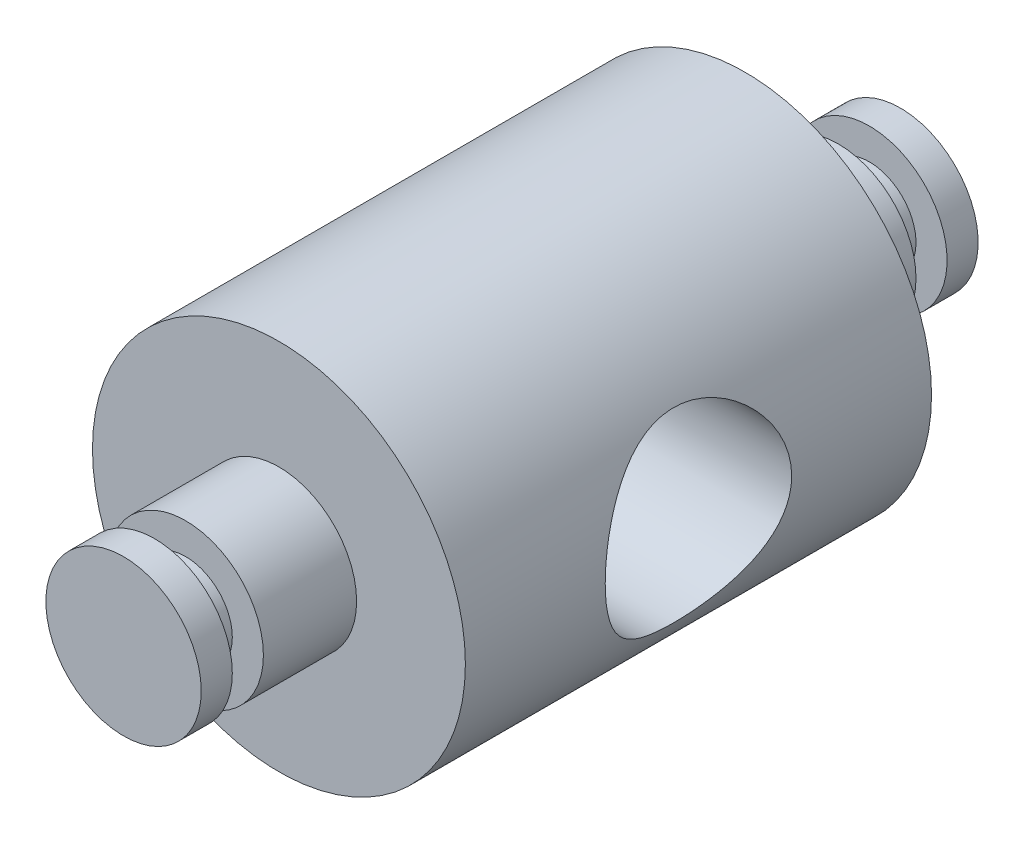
from build123d import *

# Parameters (mm, degrees)
ESQUISSE1_R                  = 6
EXTRUSION1_DEPTH             = 15
ESQUISSE2_R                  = 2.5
EXTRUSION2_DEPTH             = 3
ESQUISSE3_R                  = 1.5
EXTRUSION3_DEPTH             = 1
ESQUISSE4_R                  = 2.5
EXTRUSION4_DEPTH             = 1
EXTRUSION5_START             = 3
ESQUISSE5_R                  = 2.5
EXTRUSION5_DEPTH             = 3
EXTRUSION6_START             = 1
ESQUISSE6_R                  = 1.5
EXTRUSION6_DEPTH             = 1
EXTRUSION7_START             = 1
ESQUISSE7_R                  = 2.5
EXTRUSION7_DEPTH             = 1
ENL_V_MAT_EXTRU_1_DEPTH      = 10
ENL_V_MAT_EXTRU_1_DEPTH_BACK = 13
ESQUISSE8_R                  = 3


with BuildPart() as part:
    # Esquisse1 → Extrusion1 (new body)
    with BuildSketch(Plane.XY):
        Circle(ESQUISSE1_R)
    extrude(amount=-EXTRUSION1_DEPTH)

    # Esquisse2 → Extrusion2 (add)
    with BuildSketch(Plane.XY):
        Circle(ESQUISSE2_R)
    extrude(amount=EXTRUSION2_DEPTH)

    # Esquisse3 → Extrusion3 (add)
    with BuildSketch(Plane.XY.offset(3)):
        Circle(ESQUISSE3_R)
    extrude(amount=EXTRUSION3_DEPTH)

    # Esquisse4 → Extrusion4 (add)
    with BuildSketch(Plane.XY.offset(4)):
        Circle(ESQUISSE4_R)
    extrude(amount=EXTRUSION4_DEPTH)

    # Esquisse5 → Extrusion5 (add)
    with BuildSketch(Plane(origin=(0, 0, -15), x_dir=(-1, 0, 0), z_dir=(0, 0, -1)).offset(EXTRUSION5_START)):
        with Locations(Location((0, 0, 0), (0, 0, 180))):
            Circle(ESQUISSE5_R)
    extrude(amount=-EXTRUSION5_DEPTH)

    # Esquisse6 → Extrusion6 (add)
    with BuildSketch(Plane(origin=(0, 0, -18), x_dir=(-1, 0, 0), z_dir=(0, 0, -1)).offset(EXTRUSION6_START)):
        with Locations(Location((0, 0, 0), (0, 0, 180))):
            Circle(ESQUISSE6_R)
    extrude(amount=-EXTRUSION6_DEPTH)

    # Esquisse7 → Extrusion7 (add)
    with BuildSketch(Plane(origin=(0, 0, -19), x_dir=(-1, 0, 0), z_dir=(0, 0, -1)).offset(EXTRUSION7_START)):
        with Locations(Location((0, 0, 0), (0, 0, 180))):
            Circle(ESQUISSE7_R)
    extrude(amount=-EXTRUSION7_DEPTH)

    # Esquisse8 → Enl_v. mat.-Extru.1 (cut, two sides: drawn at the far end of the back side and taken through both)
    with BuildSketch(Plane(origin=(0, 0, 0), x_dir=(0, 0, -1), z_dir=(1, 0, 0)).offset(-ENL_V_MAT_EXTRU_1_DEPTH_BACK)):
        with Locations((7.5, 0)):
            Circle(ESQUISSE8_R)
    extrude(amount=ENL_V_MAT_EXTRU_1_DEPTH + ENL_V_MAT_EXTRU_1_DEPTH_BACK, mode=Mode.SUBTRACT)


solid = part.part
